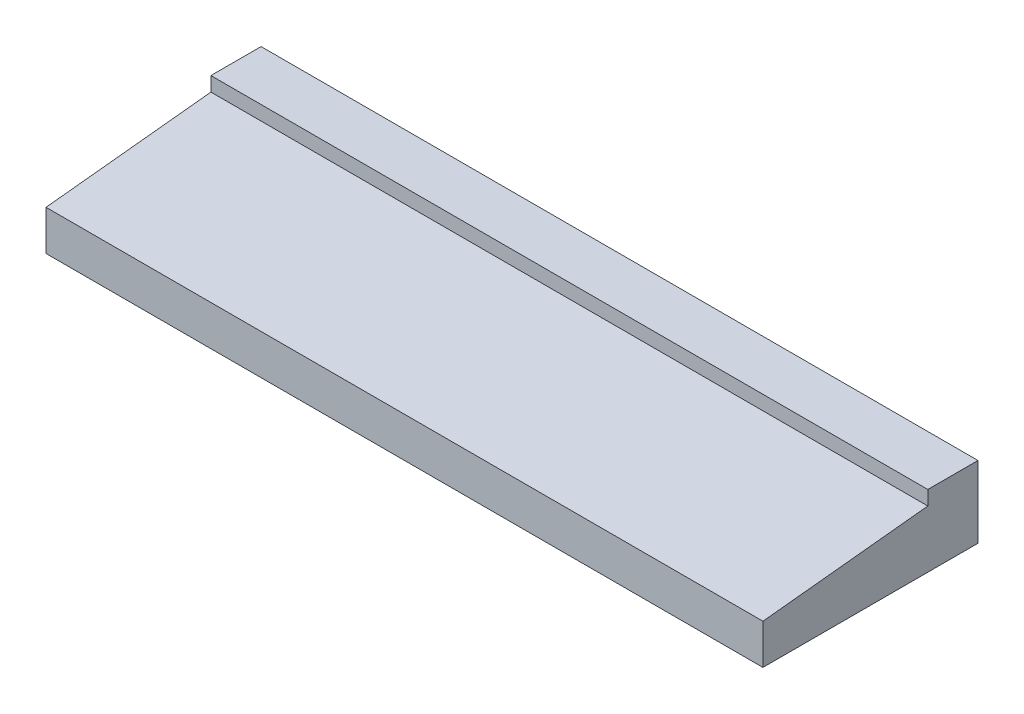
from build123d import *

# Parameters (mm, degrees)
EXTRUSION1_DEPTH = 100


with BuildPart() as part:
    # Esquisse1 → Extrusion1 (new body)
    with BuildSketch(Plane(origin=(0, 0, 0), x_dir=(0, 0, -1), z_dir=(1, 0, 0))):
        Polygon((0, 0), (0.002867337, 5.582903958), (23, 8), (23, 10), (30, 10), (30, 0), align=None)
    extrude(amount=EXTRUSION1_DEPTH)


solid = part.part
